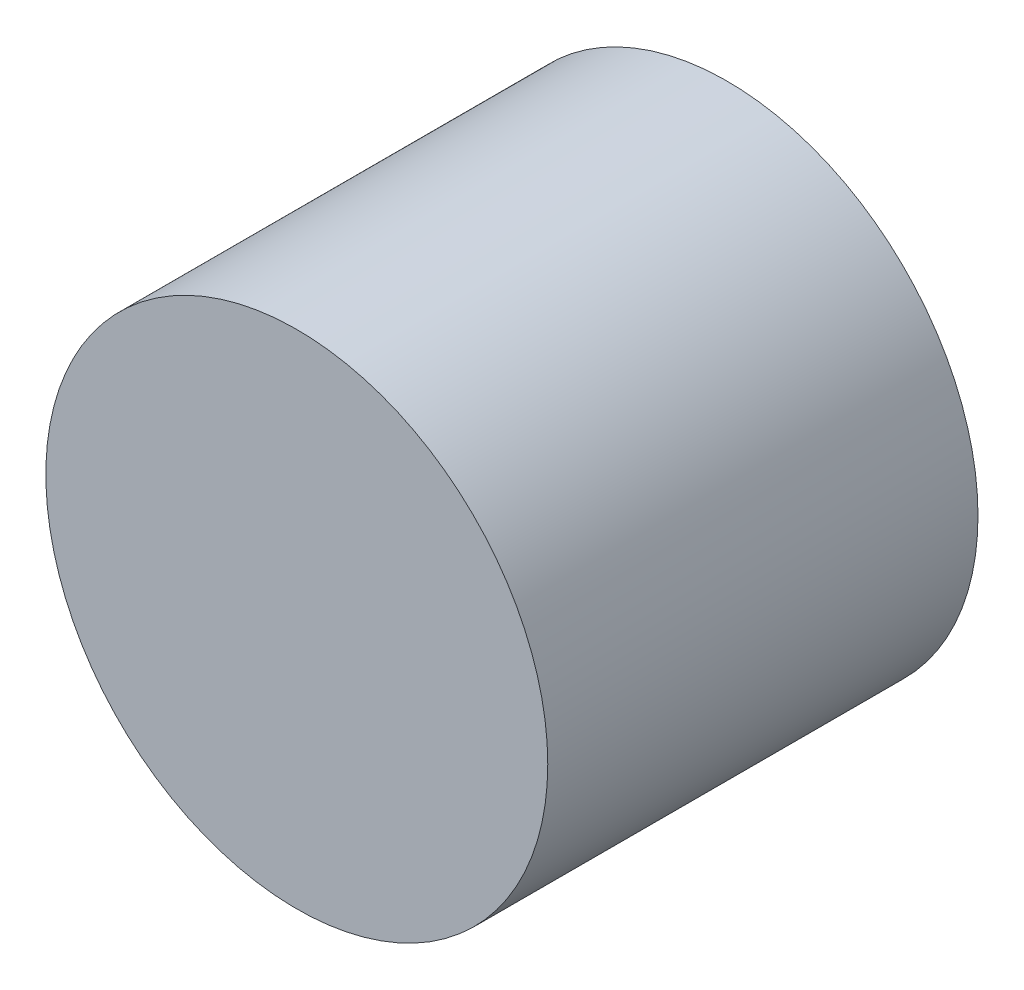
ISO-10303-21;
HEADER;
FILE_DESCRIPTION(('STEP AP214'),'2;1');
FILE_NAME('part.step','',(''),(''),'','','');
FILE_SCHEMA(('AUTOMOTIVE_DESIGN { 1 0 10303 214 1 1 1 1 }'));
ENDSEC;
DATA;
#1=APPLICATION_CONTEXT('core data for automotive mechanical design processes');
#2=APPLICATION_PROTOCOL_DEFINITION('international standard','automotive_design',2000,#1);
#3=PRODUCT_CONTEXT('',#1,'mechanical');
#4=PRODUCT('Part','Part','',(#3));
#5=PRODUCT_RELATED_PRODUCT_CATEGORY('part','',(#4));
#6=PRODUCT_DEFINITION_FORMATION('','',#4);
#7=PRODUCT_DEFINITION_CONTEXT('part definition',#1,'design');
#8=PRODUCT_DEFINITION('design','',#6,#7);
#9=PRODUCT_DEFINITION_SHAPE('','',#8);
#10=(LENGTH_UNIT() NAMED_UNIT(*) SI_UNIT(.MILLI.,.METRE.));
#11=(NAMED_UNIT(*) PLANE_ANGLE_UNIT() SI_UNIT($,.RADIAN.));
#12=(NAMED_UNIT(*) SI_UNIT($,.STERADIAN.) SOLID_ANGLE_UNIT());
#13=UNCERTAINTY_MEASURE_WITH_UNIT(LENGTH_MEASURE(1.E-05),#10,'distance_accuracy_value','');
#14=(GEOMETRIC_REPRESENTATION_CONTEXT(3) GLOBAL_UNCERTAINTY_ASSIGNED_CONTEXT((#13)) GLOBAL_UNIT_ASSIGNED_CONTEXT((#10,
#11,#12)) REPRESENTATION_CONTEXT('',''));
#15=CARTESIAN_POINT('',(0.,0.,0.));
#16=DIRECTION('',(0.,0.,1.));
#17=DIRECTION('',(1.,0.,0.));
#18=AXIS2_PLACEMENT_3D('',#15,#16,#17);
#19=CARTESIAN_POINT('',(0.,0.,30.));
#20=DIRECTION('',(0.,0.,-1.));
#21=DIRECTION('',(-1.,0.,0.));
#22=AXIS2_PLACEMENT_3D('',#19,#20,#21);
#23=CYLINDRICAL_SURFACE('',#22,17.5);
#24=CARTESIAN_POINT('',(0.,0.,30.));
#25=DIRECTION('',(0.,0.,1.));
#26=DIRECTION('',(1.,0.,0.));
#27=AXIS2_PLACEMENT_3D('',#24,#25,#26);
#28=CIRCLE('',#27,17.5);
#29=CARTESIAN_POINT('',(17.5,0.,30.));
#30=VERTEX_POINT('',#29);
#31=EDGE_CURVE('E10',#30,#30,#28,.T.);
#32=ORIENTED_EDGE('',*,*,#31,.F.);
#33=EDGE_LOOP('',(#32));
#34=FACE_BOUND('',#33,.T.);
#35=CARTESIAN_POINT('',(0.,0.,0.));
#36=DIRECTION('',(0.,0.,1.));
#37=DIRECTION('',(1.,0.,0.));
#38=AXIS2_PLACEMENT_3D('',#35,#36,#37);
#39=CIRCLE('',#38,17.5);
#40=CARTESIAN_POINT('',(17.5,0.,0.));
#41=VERTEX_POINT('',#40);
#42=EDGE_CURVE('E40',#41,#41,#39,.T.);
#43=ORIENTED_EDGE('',*,*,#42,.T.);
#44=EDGE_LOOP('',(#43));
#45=FACE_BOUND('',#44,.T.);
#46=ADVANCED_FACE('F37',(#34,#45),#23,.T.);
#47=CARTESIAN_POINT('',(0.,0.,30.));
#48=DIRECTION('',(0.,0.,1.));
#49=DIRECTION('',(1.,0.,0.));
#50=AXIS2_PLACEMENT_3D('',#47,#48,#49);
#51=PLANE('',#50);
#52=ORIENTED_EDGE('',*,*,#31,.T.);
#53=EDGE_LOOP('',(#52));
#54=FACE_BOUND('',#53,.T.);
#55=ADVANCED_FACE('F54',(#54),#51,.T.);
#56=CARTESIAN_POINT('',(0.,0.,0.));
#57=DIRECTION('',(0.,0.,1.));
#58=DIRECTION('',(1.,0.,0.));
#59=AXIS2_PLACEMENT_3D('',#56,#57,#58);
#60=PLANE('',#59);
#61=ORIENTED_EDGE('',*,*,#42,.F.);
#62=EDGE_LOOP('',(#61));
#63=FACE_BOUND('',#62,.T.);
#64=ADVANCED_FACE('F52',(#63),#60,.F.);
#65=CLOSED_SHELL('',(#46,#55,#64));
#66=MANIFOLD_SOLID_BREP('B2',#65);
#67=ADVANCED_BREP_SHAPE_REPRESENTATION('',(#18,#66),#14);
#68=SHAPE_DEFINITION_REPRESENTATION(#9,#67);
ENDSEC;
END-ISO-10303-21;
